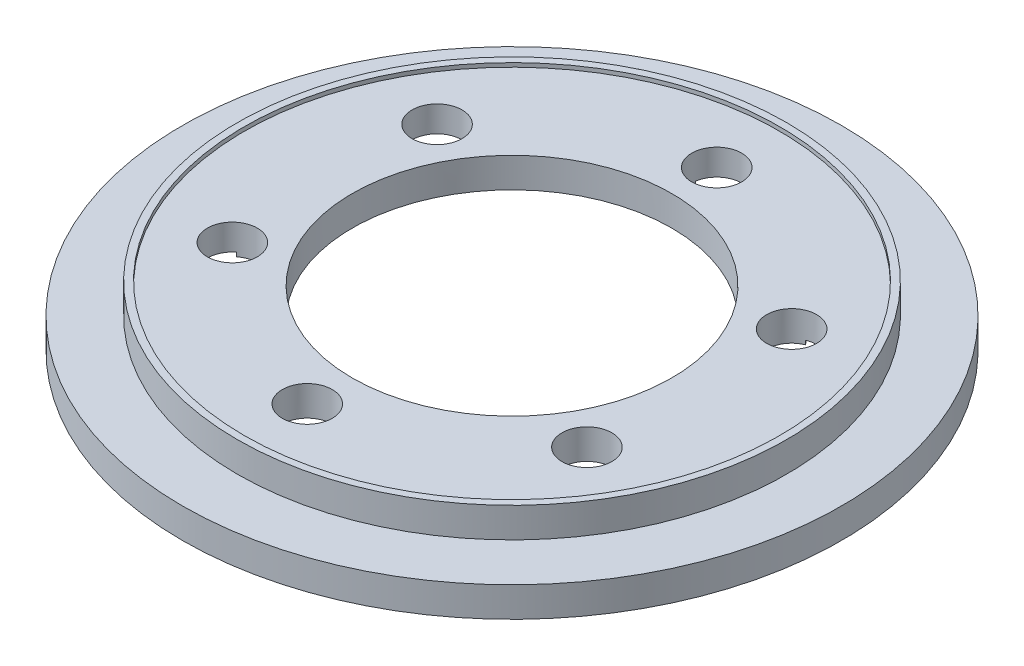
ISO-10303-21;
HEADER;
FILE_DESCRIPTION(('STEP AP214'),'2;1');
FILE_NAME('part.step','',(''),(''),'','','');
FILE_SCHEMA(('AUTOMOTIVE_DESIGN { 1 0 10303 214 1 1 1 1 }'));
ENDSEC;
DATA;
#1=APPLICATION_CONTEXT('core data for automotive mechanical design processes');
#2=APPLICATION_PROTOCOL_DEFINITION('international standard','automotive_design',2000,#1);
#3=PRODUCT_CONTEXT('',#1,'mechanical');
#4=PRODUCT('Part','Part','',(#3));
#5=PRODUCT_RELATED_PRODUCT_CATEGORY('part','',(#4));
#6=PRODUCT_DEFINITION_FORMATION('','',#4);
#7=PRODUCT_DEFINITION_CONTEXT('part definition',#1,'design');
#8=PRODUCT_DEFINITION('design','',#6,#7);
#9=PRODUCT_DEFINITION_SHAPE('','',#8);
#10=(LENGTH_UNIT() NAMED_UNIT(*) SI_UNIT(.MILLI.,.METRE.));
#11=(NAMED_UNIT(*) PLANE_ANGLE_UNIT() SI_UNIT($,.RADIAN.));
#12=(NAMED_UNIT(*) SI_UNIT($,.STERADIAN.) SOLID_ANGLE_UNIT());
#13=UNCERTAINTY_MEASURE_WITH_UNIT(LENGTH_MEASURE(1.E-05),#10,'distance_accuracy_value','');
#14=(GEOMETRIC_REPRESENTATION_CONTEXT(3) GLOBAL_UNCERTAINTY_ASSIGNED_CONTEXT((#13)) GLOBAL_UNIT_ASSIGNED_CONTEXT((#10,
#11,#12)) REPRESENTATION_CONTEXT('',''));
#15=CARTESIAN_POINT('',(0.,0.,0.));
#16=DIRECTION('',(0.,0.,1.));
#17=DIRECTION('',(1.,0.,0.));
#18=AXIS2_PLACEMENT_3D('',#15,#16,#17);
#19=CARTESIAN_POINT('',(0.,1.3,0.));
#20=DIRECTION('',(0.,1.,0.));
#21=DIRECTION('',(0.,0.,1.));
#22=AXIS2_PLACEMENT_3D('',#19,#20,#21);
#23=CYLINDRICAL_SURFACE('',#22,10.5);
#24=CARTESIAN_POINT('',(0.,1.5,0.));
#25=DIRECTION('',(0.,-1.,0.));
#26=DIRECTION('',(0.,0.,-1.));
#27=AXIS2_PLACEMENT_3D('',#24,#25,#26);
#28=CIRCLE('',#27,10.5);
#29=CARTESIAN_POINT('',(-9.64861370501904,1.5,4.14176937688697));
#30=VERTEX_POINT('',#29);
#31=CARTESIAN_POINT('',(-9.64861370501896,1.5,-4.14176937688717));
#32=VERTEX_POINT('',#31);
#33=EDGE_CURVE('E269',#30,#32,#28,.T.);
#34=ORIENTED_EDGE('',*,*,#33,.T.);
#35=DIRECTION('',(0.,1.,0.));
#36=VECTOR('',#35,1.);
#37=CARTESIAN_POINT('',(-9.64861370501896,1.5,-4.14176937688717));
#38=LINE('',#37,#36);
#39=CARTESIAN_POINT('',(-9.64861370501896,1.3,-4.14176937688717));
#40=VERTEX_POINT('',#39);
#41=EDGE_CURVE('E11',#32,#40,#38,.F.);
#42=ORIENTED_EDGE('',*,*,#41,.T.);
#43=CARTESIAN_POINT('',(0.,1.3,0.));
#44=DIRECTION('',(0.,-1.,0.));
#45=DIRECTION('',(0.,0.,-1.));
#46=AXIS2_PLACEMENT_3D('',#43,#44,#45);
#47=CIRCLE('',#46,10.5);
#48=CARTESIAN_POINT('',(-9.64861370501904,1.3,4.14176937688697));
#49=VERTEX_POINT('',#48);
#50=EDGE_CURVE('E396',#49,#40,#47,.T.);
#51=ORIENTED_EDGE('',*,*,#50,.F.);
#52=DIRECTION('',(0.,1.,0.));
#53=VECTOR('',#52,1.);
#54=CARTESIAN_POINT('',(-9.64861370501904,1.5,4.14176937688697));
#55=LINE('',#54,#53);
#56=EDGE_CURVE('E248',#49,#30,#55,.T.);
#57=ORIENTED_EDGE('',*,*,#56,.T.);
#58=EDGE_LOOP('',(#34,#42,#51,#57));
#59=FACE_BOUND('',#58,.T.);
#60=ADVANCED_FACE('F43',(#59),#23,.T.);
#61=CARTESIAN_POINT('',(-1.23742935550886,1.5,10.4268292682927));
#62=VERTEX_POINT('',#61);
#63=CARTESIAN_POINT('',(-8.4111843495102,1.5,6.28505989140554));
#64=VERTEX_POINT('',#63);
#65=EDGE_CURVE('E272',#62,#64,#28,.T.);
#66=ORIENTED_EDGE('',*,*,#65,.T.);
#67=DIRECTION('',(0.,1.,0.));
#68=VECTOR('',#67,1.);
#69=CARTESIAN_POINT('',(-8.4111843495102,1.5,6.28505989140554));
#70=LINE('',#69,#68);
#71=CARTESIAN_POINT('',(-8.4111843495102,1.3,6.28505989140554));
#72=VERTEX_POINT('',#71);
#73=EDGE_CURVE('E251',#64,#72,#70,.F.);
#74=ORIENTED_EDGE('',*,*,#73,.T.);
#75=CARTESIAN_POINT('',(-1.23742935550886,1.3,10.4268292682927));
#76=VERTEX_POINT('',#75);
#77=EDGE_CURVE('E171',#76,#72,#47,.T.);
#78=ORIENTED_EDGE('',*,*,#77,.F.);
#79=DIRECTION('',(0.,1.,0.));
#80=VECTOR('',#79,1.);
#81=CARTESIAN_POINT('',(-1.23742935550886,1.5,10.4268292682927));
#82=LINE('',#81,#80);
#83=EDGE_CURVE('E240',#76,#62,#82,.T.);
#84=ORIENTED_EDGE('',*,*,#83,.T.);
#85=EDGE_LOOP('',(#66,#74,#78,#84));
#86=FACE_BOUND('',#85,.T.);
#87=ADVANCED_FACE('F360',(#86),#23,.T.);
#88=CARTESIAN_POINT('',(8.41118434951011,1.5,6.28505989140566));
#89=VERTEX_POINT('',#88);
#90=CARTESIAN_POINT('',(1.23742935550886,1.5,10.4268292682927));
#91=VERTEX_POINT('',#90);
#92=EDGE_CURVE('E384',#89,#91,#28,.T.);
#93=ORIENTED_EDGE('',*,*,#92,.T.);
#94=DIRECTION('',(0.,1.,0.));
#95=VECTOR('',#94,1.);
#96=CARTESIAN_POINT('',(1.23742935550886,1.5,10.4268292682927));
#97=LINE('',#96,#95);
#98=CARTESIAN_POINT('',(1.23742935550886,1.3,10.4268292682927));
#99=VERTEX_POINT('',#98);
#100=EDGE_CURVE('E244',#91,#99,#97,.F.);
#101=ORIENTED_EDGE('',*,*,#100,.T.);
#102=CARTESIAN_POINT('',(8.41118434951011,1.3,6.28505989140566));
#103=VERTEX_POINT('',#102);
#104=EDGE_CURVE('E164',#103,#99,#47,.T.);
#105=ORIENTED_EDGE('',*,*,#104,.F.);
#106=DIRECTION('',(0.,1.,0.));
#107=VECTOR('',#106,1.);
#108=CARTESIAN_POINT('',(8.41118434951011,1.5,6.28505989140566));
#109=LINE('',#108,#107);
#110=EDGE_CURVE('E234',#103,#89,#109,.T.);
#111=ORIENTED_EDGE('',*,*,#110,.T.);
#112=EDGE_LOOP('',(#93,#101,#105,#111));
#113=FACE_BOUND('',#112,.T.);
#114=ADVANCED_FACE('F366',(#113),#23,.T.);
#115=CARTESIAN_POINT('',(9.64861370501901,1.5,-4.14176937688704));
#116=VERTEX_POINT('',#115);
#117=CARTESIAN_POINT('',(9.64861370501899,1.5,4.14176937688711));
#118=VERTEX_POINT('',#117);
#119=EDGE_CURVE('E180',#116,#118,#28,.T.);
#120=ORIENTED_EDGE('',*,*,#119,.T.);
#121=DIRECTION('',(0.,1.,0.));
#122=VECTOR('',#121,1.);
#123=CARTESIAN_POINT('',(9.64861370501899,1.5,4.14176937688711));
#124=LINE('',#123,#122);
#125=CARTESIAN_POINT('',(9.64861370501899,1.3,4.14176937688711));
#126=VERTEX_POINT('',#125);
#127=EDGE_CURVE('E162',#118,#126,#124,.F.);
#128=ORIENTED_EDGE('',*,*,#127,.T.);
#129=CARTESIAN_POINT('',(9.64861370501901,1.3,-4.14176937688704));
#130=VERTEX_POINT('',#129);
#131=EDGE_CURVE('E154',#130,#126,#47,.T.);
#132=ORIENTED_EDGE('',*,*,#131,.F.);
#133=DIRECTION('',(0.,1.,0.));
#134=VECTOR('',#133,1.);
#135=CARTESIAN_POINT('',(9.64861370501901,1.5,-4.14176937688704));
#136=LINE('',#135,#134);
#137=EDGE_CURVE('E132',#130,#116,#136,.T.);
#138=ORIENTED_EDGE('',*,*,#137,.T.);
#139=EDGE_LOOP('',(#120,#128,#132,#138));
#140=FACE_BOUND('',#139,.T.);
#141=ADVANCED_FACE('F161',(#140),#23,.T.);
#142=CARTESIAN_POINT('',(1.23742935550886,1.5,-10.4268292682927));
#143=VERTEX_POINT('',#142);
#144=CARTESIAN_POINT('',(8.41118434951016,1.5,-6.2850598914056));
#145=VERTEX_POINT('',#144);
#146=EDGE_CURVE('E176',#143,#145,#28,.T.);
#147=ORIENTED_EDGE('',*,*,#146,.T.);
#148=DIRECTION('',(0.,1.,0.));
#149=VECTOR('',#148,1.);
#150=CARTESIAN_POINT('',(8.41118434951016,1.5,-6.2850598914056));
#151=LINE('',#150,#149);
#152=CARTESIAN_POINT('',(8.41118434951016,1.3,-6.2850598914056));
#153=VERTEX_POINT('',#152);
#154=EDGE_CURVE('E144',#145,#153,#151,.F.);
#155=ORIENTED_EDGE('',*,*,#154,.T.);
#156=CARTESIAN_POINT('',(1.23742935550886,1.3,-10.4268292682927));
#157=VERTEX_POINT('',#156);
#158=EDGE_CURVE('E157',#157,#153,#47,.T.);
#159=ORIENTED_EDGE('',*,*,#158,.F.);
#160=DIRECTION('',(0.,1.,0.));
#161=VECTOR('',#160,1.);
#162=CARTESIAN_POINT('',(1.23742935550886,1.5,-10.4268292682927));
#163=LINE('',#162,#161);
#164=EDGE_CURVE('E215',#157,#143,#163,.T.);
#165=ORIENTED_EDGE('',*,*,#164,.T.);
#166=EDGE_LOOP('',(#147,#155,#159,#165));
#167=FACE_BOUND('',#166,.T.);
#168=ADVANCED_FACE('F355',(#167),#23,.T.);
#169=CARTESIAN_POINT('',(0.,1.5,0.));
#170=DIRECTION('',(0.,-1.,0.));
#171=DIRECTION('',(0.,0.,-1.));
#172=AXIS2_PLACEMENT_3D('',#169,#170,#171);
#173=PLANE('',#172);
#174=CARTESIAN_POINT('',(-8.87676038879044,1.5,-5.1250000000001));
#175=DIRECTION('',(0.,-1.,0.));
#176=DIRECTION('',(0.,0.,-1.));
#177=AXIS2_PLACEMENT_3D('',#174,#175,#176);
#178=CIRCLE('',#177,1.25);
#179=CARTESIAN_POINT('',(-8.41118434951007,1.5,-6.28505989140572));
#180=VERTEX_POINT('',#179);
#181=EDGE_CURVE('E59',#32,#180,#178,.T.);
#182=ORIENTED_EDGE('',*,*,#181,.F.);
#183=ORIENTED_EDGE('',*,*,#33,.F.);
#184=CARTESIAN_POINT('',(-8.87676038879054,1.5,5.12499999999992));
#185=DIRECTION('',(0.,-1.,0.));
#186=DIRECTION('',(0.,0.,-1.));
#187=AXIS2_PLACEMENT_3D('',#184,#185,#186);
#188=CIRCLE('',#187,1.25);
#189=EDGE_CURVE('E67',#64,#30,#188,.T.);
#190=ORIENTED_EDGE('',*,*,#189,.F.);
#191=ORIENTED_EDGE('',*,*,#65,.F.);
#192=CARTESIAN_POINT('',(0.,1.5,10.25));
#193=DIRECTION('',(0.,-1.,0.));
#194=DIRECTION('',(0.,0.,-1.));
#195=AXIS2_PLACEMENT_3D('',#192,#193,#194);
#196=CIRCLE('',#195,1.25);
#197=EDGE_CURVE('E310',#91,#62,#196,.T.);
#198=ORIENTED_EDGE('',*,*,#197,.F.);
#199=ORIENTED_EDGE('',*,*,#92,.F.);
#200=CARTESIAN_POINT('',(8.87676038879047,1.5,5.12500000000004));
#201=DIRECTION('',(0.,-1.,0.));
#202=DIRECTION('',(0.,0.,-1.));
#203=AXIS2_PLACEMENT_3D('',#200,#201,#202);
#204=CIRCLE('',#203,1.25);
#205=EDGE_CURVE('E320',#118,#89,#204,.T.);
#206=ORIENTED_EDGE('',*,*,#205,.F.);
#207=ORIENTED_EDGE('',*,*,#119,.F.);
#208=CARTESIAN_POINT('',(8.87676038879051,1.5,-5.12499999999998));
#209=DIRECTION('',(0.,-1.,0.));
#210=DIRECTION('',(0.,0.,-1.));
#211=AXIS2_PLACEMENT_3D('',#208,#209,#210);
#212=CIRCLE('',#211,1.25);
#213=EDGE_CURVE('E138',#145,#116,#212,.T.);
#214=ORIENTED_EDGE('',*,*,#213,.F.);
#215=ORIENTED_EDGE('',*,*,#146,.F.);
#216=CARTESIAN_POINT('',(0.,1.5,-10.25));
#217=DIRECTION('',(0.,-1.,0.));
#218=DIRECTION('',(0.,0.,-1.));
#219=AXIS2_PLACEMENT_3D('',#216,#217,#218);
#220=CIRCLE('',#219,1.25);
#221=CARTESIAN_POINT('',(-1.23742935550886,1.5,-10.4268292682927));
#222=VERTEX_POINT('',#221);
#223=EDGE_CURVE('E267',#222,#143,#220,.T.);
#224=ORIENTED_EDGE('',*,*,#223,.F.);
#225=EDGE_CURVE('E181',#180,#222,#28,.T.);
#226=ORIENTED_EDGE('',*,*,#225,.F.);
#227=EDGE_LOOP('',(#182,#183,#190,#191,#198,#199,#206,#207,#214,#215,#224,#226));
#228=FACE_BOUND('',#227,.T.);
#229=CARTESIAN_POINT('',(0.,1.5,0.));
#230=DIRECTION('',(0.,-1.,0.));
#231=DIRECTION('',(0.,0.,-1.));
#232=AXIS2_PLACEMENT_3D('',#229,#230,#231);
#233=CIRCLE('',#232,12.5);
#234=CARTESIAN_POINT('',(0.,1.5,-12.5));
#235=VERTEX_POINT('',#234);
#236=EDGE_CURVE('E190',#235,#235,#233,.T.);
#237=ORIENTED_EDGE('',*,*,#236,.T.);
#238=EDGE_LOOP('',(#237));
#239=FACE_BOUND('',#238,.T.);
#240=ADVANCED_FACE('F262',(#228,#239),#173,.T.);
#241=CARTESIAN_POINT('',(0.,0.,0.));
#242=DIRECTION('',(0.,1.,0.));
#243=DIRECTION('',(0.,0.,1.));
#244=AXIS2_PLACEMENT_3D('',#241,#242,#243);
#245=CYLINDRICAL_SURFACE('',#244,8.);
#246=CARTESIAN_POINT('',(0.,2.8,0.));
#247=DIRECTION('',(0.,1.,0.));
#248=DIRECTION('',(0.,0.,1.));
#249=AXIS2_PLACEMENT_3D('',#246,#247,#248);
#250=CIRCLE('',#249,8.);
#251=CARTESIAN_POINT('',(0.,2.8,8.));
#252=VERTEX_POINT('',#251);
#253=EDGE_CURVE('E186',#252,#252,#250,.F.);
#254=ORIENTED_EDGE('',*,*,#253,.F.);
#255=EDGE_LOOP('',(#254));
#256=FACE_BOUND('',#255,.T.);
#257=CARTESIAN_POINT('',(0.,1.3,0.));
#258=DIRECTION('',(0.,-1.,0.));
#259=DIRECTION('',(0.,0.,-1.));
#260=AXIS2_PLACEMENT_3D('',#257,#258,#259);
#261=CIRCLE('',#260,8.);
#262=CARTESIAN_POINT('',(0.,1.3,-8.));
#263=VERTEX_POINT('',#262);
#264=EDGE_CURVE('E174',#263,#263,#261,.T.);
#265=ORIENTED_EDGE('',*,*,#264,.T.);
#266=EDGE_LOOP('',(#265));
#267=FACE_BOUND('',#266,.T.);
#268=ADVANCED_FACE('F346',(#256,#267),#245,.F.);
#269=CARTESIAN_POINT('',(0.,1.5,0.));
#270=DIRECTION('',(0.,-1.,0.));
#271=DIRECTION('',(0.,0.,-1.));
#272=AXIS2_PLACEMENT_3D('',#269,#270,#271);
#273=CYLINDRICAL_SURFACE('',#272,16.5);
#274=CARTESIAN_POINT('',(0.,1.5,0.));
#275=DIRECTION('',(0.,1.,0.));
#276=DIRECTION('',(0.,0.,1.));
#277=AXIS2_PLACEMENT_3D('',#274,#275,#276);
#278=CIRCLE('',#277,16.5);
#279=CARTESIAN_POINT('',(0.,1.5,16.5));
#280=VERTEX_POINT('',#279);
#281=EDGE_CURVE('E216',#280,#280,#278,.T.);
#282=ORIENTED_EDGE('',*,*,#281,.F.);
#283=EDGE_LOOP('',(#282));
#284=FACE_BOUND('',#283,.T.);
#285=CARTESIAN_POINT('',(0.,0.,0.));
#286=DIRECTION('',(0.,1.,0.));
#287=DIRECTION('',(0.,0.,1.));
#288=AXIS2_PLACEMENT_3D('',#285,#286,#287);
#289=CIRCLE('',#288,16.5);
#290=CARTESIAN_POINT('',(0.,0.,16.5));
#291=VERTEX_POINT('',#290);
#292=EDGE_CURVE('E210',#291,#291,#289,.T.);
#293=ORIENTED_EDGE('',*,*,#292,.T.);
#294=EDGE_LOOP('',(#293));
#295=FACE_BOUND('',#294,.T.);
#296=ADVANCED_FACE('F45',(#284,#295),#273,.T.);
#297=CARTESIAN_POINT('',(0.,1.5,0.));
#298=DIRECTION('',(0.,1.,0.));
#299=DIRECTION('',(0.,0.,1.));
#300=AXIS2_PLACEMENT_3D('',#297,#298,#299);
#301=PLANE('',#300);
#302=CARTESIAN_POINT('',(0.,1.5,0.));
#303=DIRECTION('',(0.,1.,0.));
#304=DIRECTION('',(0.,0.,1.));
#305=AXIS2_PLACEMENT_3D('',#302,#303,#304);
#306=CIRCLE('',#305,13.75);
#307=CARTESIAN_POINT('',(0.,1.5,13.75));
#308=VERTEX_POINT('',#307);
#309=EDGE_CURVE('E211',#308,#308,#306,.T.);
#310=ORIENTED_EDGE('',*,*,#309,.F.);
#311=EDGE_LOOP('',(#310));
#312=FACE_BOUND('',#311,.T.);
#313=ORIENTED_EDGE('',*,*,#281,.T.);
#314=EDGE_LOOP('',(#313));
#315=FACE_BOUND('',#314,.T.);
#316=ADVANCED_FACE('F353',(#312,#315),#301,.T.);
#317=CARTESIAN_POINT('',(0.,0.,0.));
#318=DIRECTION('',(0.,1.,0.));
#319=DIRECTION('',(0.,0.,1.));
#320=AXIS2_PLACEMENT_3D('',#317,#318,#319);
#321=PLANE('',#320);
#322=CARTESIAN_POINT('',(0.,0.,0.));
#323=DIRECTION('',(0.,-1.,0.));
#324=DIRECTION('',(0.,0.,-1.));
#325=AXIS2_PLACEMENT_3D('',#322,#323,#324);
#326=CIRCLE('',#325,15.5);
#327=CARTESIAN_POINT('',(0.,0.,-15.5));
#328=VERTEX_POINT('',#327);
#329=EDGE_CURVE('E194',#328,#328,#326,.T.);
#330=ORIENTED_EDGE('',*,*,#329,.F.);
#331=EDGE_LOOP('',(#330));
#332=FACE_BOUND('',#331,.T.);
#333=ORIENTED_EDGE('',*,*,#292,.F.);
#334=EDGE_LOOP('',(#333));
#335=FACE_BOUND('',#334,.T.);
#336=ADVANCED_FACE('F595',(#332,#335),#321,.F.);
#337=CARTESIAN_POINT('',(0.,3.,0.));
#338=DIRECTION('',(0.,-1.,0.));
#339=DIRECTION('',(0.,0.,-1.));
#340=AXIS2_PLACEMENT_3D('',#337,#338,#339);
#341=CYLINDRICAL_SURFACE('',#340,13.75);
#342=CARTESIAN_POINT('',(0.,3.,0.));
#343=DIRECTION('',(0.,1.,0.));
#344=DIRECTION('',(0.,0.,1.));
#345=AXIS2_PLACEMENT_3D('',#342,#343,#344);
#346=CIRCLE('',#345,13.75);
#347=CARTESIAN_POINT('',(0.,3.,13.75));
#348=VERTEX_POINT('',#347);
#349=EDGE_CURVE('E203',#348,#348,#346,.T.);
#350=ORIENTED_EDGE('',*,*,#349,.F.);
#351=EDGE_LOOP('',(#350));
#352=FACE_BOUND('',#351,.T.);
#353=ORIENTED_EDGE('',*,*,#309,.T.);
#354=EDGE_LOOP('',(#353));
#355=FACE_BOUND('',#354,.T.);
#356=ADVANCED_FACE('F558',(#352,#355),#341,.T.);
#357=CARTESIAN_POINT('',(0.,3.,0.));
#358=DIRECTION('',(0.,1.,0.));
#359=DIRECTION('',(0.,0.,1.));
#360=AXIS2_PLACEMENT_3D('',#357,#358,#359);
#361=PLANE('',#360);
#362=CARTESIAN_POINT('',(0.,3.,0.));
#363=DIRECTION('',(0.,1.,0.));
#364=DIRECTION('',(0.,0.,1.));
#365=AXIS2_PLACEMENT_3D('',#362,#363,#364);
#366=CIRCLE('',#365,13.4);
#367=CARTESIAN_POINT('',(0.,3.,13.4));
#368=VERTEX_POINT('',#367);
#369=EDGE_CURVE('E168',#368,#368,#366,.T.);
#370=ORIENTED_EDGE('',*,*,#369,.F.);
#371=EDGE_LOOP('',(#370));
#372=FACE_BOUND('',#371,.T.);
#373=ORIENTED_EDGE('',*,*,#349,.T.);
#374=EDGE_LOOP('',(#373));
#375=FACE_BOUND('',#374,.T.);
#376=ADVANCED_FACE('F552',(#372,#375),#361,.T.);
#377=CARTESIAN_POINT('',(0.,1.,0.));
#378=DIRECTION('',(0.,-1.,0.));
#379=DIRECTION('',(0.,0.,-1.));
#380=AXIS2_PLACEMENT_3D('',#377,#378,#379);
#381=CYLINDRICAL_SURFACE('',#380,15.5);
#382=CARTESIAN_POINT('',(0.,1.,0.));
#383=DIRECTION('',(0.,-1.,0.));
#384=DIRECTION('',(0.,0.,-1.));
#385=AXIS2_PLACEMENT_3D('',#382,#383,#384);
#386=CIRCLE('',#385,15.5);
#387=CARTESIAN_POINT('',(0.,1.,-15.5));
#388=VERTEX_POINT('',#387);
#389=EDGE_CURVE('E199',#388,#388,#386,.T.);
#390=ORIENTED_EDGE('',*,*,#389,.F.);
#391=EDGE_LOOP('',(#390));
#392=FACE_BOUND('',#391,.T.);
#393=ORIENTED_EDGE('',*,*,#329,.T.);
#394=EDGE_LOOP('',(#393));
#395=FACE_BOUND('',#394,.T.);
#396=ADVANCED_FACE('F557',(#392,#395),#381,.F.);
#397=CARTESIAN_POINT('',(0.,1.,0.));
#398=DIRECTION('',(0.,-1.,0.));
#399=DIRECTION('',(0.,0.,-1.));
#400=AXIS2_PLACEMENT_3D('',#397,#398,#399);
#401=PLANE('',#400);
#402=CARTESIAN_POINT('',(0.,1.,0.));
#403=DIRECTION('',(0.,-1.,0.));
#404=DIRECTION('',(0.,0.,-1.));
#405=AXIS2_PLACEMENT_3D('',#402,#403,#404);
#406=CIRCLE('',#405,12.5);
#407=CARTESIAN_POINT('',(0.,1.,-12.5));
#408=VERTEX_POINT('',#407);
#409=EDGE_CURVE('E195',#408,#408,#406,.T.);
#410=ORIENTED_EDGE('',*,*,#409,.F.);
#411=EDGE_LOOP('',(#410));
#412=FACE_BOUND('',#411,.T.);
#413=ORIENTED_EDGE('',*,*,#389,.T.);
#414=EDGE_LOOP('',(#413));
#415=FACE_BOUND('',#414,.T.);
#416=ADVANCED_FACE('F572',(#412,#415),#401,.T.);
#417=CARTESIAN_POINT('',(0.,1.5,0.));
#418=DIRECTION('',(0.,-1.,0.));
#419=DIRECTION('',(0.,0.,-1.));
#420=AXIS2_PLACEMENT_3D('',#417,#418,#419);
#421=CYLINDRICAL_SURFACE('',#420,12.5);
#422=ORIENTED_EDGE('',*,*,#236,.F.);
#423=EDGE_LOOP('',(#422));
#424=FACE_BOUND('',#423,.T.);
#425=ORIENTED_EDGE('',*,*,#409,.T.);
#426=EDGE_LOOP('',(#425));
#427=FACE_BOUND('',#426,.T.);
#428=ADVANCED_FACE('F338',(#424,#427),#421,.F.);
#429=CARTESIAN_POINT('',(0.,2.8,0.));
#430=DIRECTION('',(0.,1.,0.));
#431=DIRECTION('',(0.,0.,1.));
#432=AXIS2_PLACEMENT_3D('',#429,#430,#431);
#433=PLANE('',#432);
#434=CARTESIAN_POINT('',(-8.87676038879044,2.8,-5.1250000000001));
#435=DIRECTION('',(0.,1.,0.));
#436=DIRECTION('',(0.,0.,1.));
#437=AXIS2_PLACEMENT_3D('',#434,#435,#436);
#438=CIRCLE('',#437,1.25);
#439=CARTESIAN_POINT('',(-8.87676038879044,2.8,-3.8750000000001));
#440=VERTEX_POINT('',#439);
#441=EDGE_CURVE('E288',#440,#440,#438,.T.);
#442=ORIENTED_EDGE('',*,*,#441,.F.);
#443=EDGE_LOOP('',(#442));
#444=FACE_BOUND('',#443,.T.);
#445=CARTESIAN_POINT('',(-8.87676038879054,2.8,5.12499999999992));
#446=DIRECTION('',(0.,1.,0.));
#447=DIRECTION('',(0.,0.,1.));
#448=AXIS2_PLACEMENT_3D('',#445,#446,#447);
#449=CIRCLE('',#448,1.25);
#450=CARTESIAN_POINT('',(-8.87676038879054,2.8,6.37499999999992));
#451=VERTEX_POINT('',#450);
#452=EDGE_CURVE('E297',#451,#451,#449,.T.);
#453=ORIENTED_EDGE('',*,*,#452,.F.);
#454=EDGE_LOOP('',(#453));
#455=FACE_BOUND('',#454,.T.);
#456=CARTESIAN_POINT('',(0.,2.8,10.25));
#457=DIRECTION('',(0.,1.,0.));
#458=DIRECTION('',(0.,0.,1.));
#459=AXIS2_PLACEMENT_3D('',#456,#457,#458);
#460=CIRCLE('',#459,1.25);
#461=CARTESIAN_POINT('',(0.,2.8,11.5));
#462=VERTEX_POINT('',#461);
#463=EDGE_CURVE('E306',#462,#462,#460,.T.);
#464=ORIENTED_EDGE('',*,*,#463,.F.);
#465=EDGE_LOOP('',(#464));
#466=FACE_BOUND('',#465,.T.);
#467=CARTESIAN_POINT('',(8.87676038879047,2.8,5.12500000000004));
#468=DIRECTION('',(0.,1.,0.));
#469=DIRECTION('',(0.,0.,1.));
#470=AXIS2_PLACEMENT_3D('',#467,#468,#469);
#471=CIRCLE('',#470,1.25);
#472=CARTESIAN_POINT('',(8.87676038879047,2.8,6.37500000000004));
#473=VERTEX_POINT('',#472);
#474=EDGE_CURVE('E316',#473,#473,#471,.T.);
#475=ORIENTED_EDGE('',*,*,#474,.F.);
#476=EDGE_LOOP('',(#475));
#477=FACE_BOUND('',#476,.T.);
#478=CARTESIAN_POINT('',(8.87676038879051,2.8,-5.12499999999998));
#479=DIRECTION('',(0.,1.,0.));
#480=DIRECTION('',(0.,0.,1.));
#481=AXIS2_PLACEMENT_3D('',#478,#479,#480);
#482=CIRCLE('',#481,1.25);
#483=CARTESIAN_POINT('',(8.87676038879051,2.8,-3.87499999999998));
#484=VERTEX_POINT('',#483);
#485=EDGE_CURVE('E326',#484,#484,#482,.T.);
#486=ORIENTED_EDGE('',*,*,#485,.F.);
#487=EDGE_LOOP('',(#486));
#488=FACE_BOUND('',#487,.T.);
#489=CARTESIAN_POINT('',(0.,2.8,-10.25));
#490=DIRECTION('',(0.,1.,0.));
#491=DIRECTION('',(0.,0.,1.));
#492=AXIS2_PLACEMENT_3D('',#489,#490,#491);
#493=CIRCLE('',#492,1.25);
#494=CARTESIAN_POINT('',(0.,2.8,-9.));
#495=VERTEX_POINT('',#494);
#496=EDGE_CURVE('E274',#495,#495,#493,.T.);
#497=ORIENTED_EDGE('',*,*,#496,.F.);
#498=EDGE_LOOP('',(#497));
#499=FACE_BOUND('',#498,.T.);
#500=CARTESIAN_POINT('',(0.,2.8,0.));
#501=DIRECTION('',(0.,1.,0.));
#502=DIRECTION('',(0.,0.,1.));
#503=AXIS2_PLACEMENT_3D('',#500,#501,#502);
#504=CIRCLE('',#503,13.4);
#505=CARTESIAN_POINT('',(0.,2.8,13.4));
#506=VERTEX_POINT('',#505);
#507=EDGE_CURVE('E182',#506,#506,#504,.T.);
#508=ORIENTED_EDGE('',*,*,#507,.T.);
#509=EDGE_LOOP('',(#508));
#510=FACE_BOUND('',#509,.T.);
#511=ORIENTED_EDGE('',*,*,#253,.T.);
#512=EDGE_LOOP('',(#511));
#513=FACE_BOUND('',#512,.T.);
#514=ADVANCED_FACE('F334',(#444,#455,#466,#477,#488,#499,#510,#513),#433,.T.);
#515=CARTESIAN_POINT('',(0.,2.8,0.));
#516=DIRECTION('',(0.,1.,0.));
#517=DIRECTION('',(0.,0.,1.));
#518=AXIS2_PLACEMENT_3D('',#515,#516,#517);
#519=CYLINDRICAL_SURFACE('',#518,13.4);
#520=ORIENTED_EDGE('',*,*,#507,.F.);
#521=EDGE_LOOP('',(#520));
#522=FACE_BOUND('',#521,.T.);
#523=ORIENTED_EDGE('',*,*,#369,.T.);
#524=EDGE_LOOP('',(#523));
#525=FACE_BOUND('',#524,.T.);
#526=ADVANCED_FACE('F337',(#522,#525),#519,.F.);
#527=CARTESIAN_POINT('',(0.,1.3,0.));
#528=DIRECTION('',(0.,-1.,0.));
#529=DIRECTION('',(0.,0.,-1.));
#530=AXIS2_PLACEMENT_3D('',#527,#528,#529);
#531=PLANE('',#530);
#532=CARTESIAN_POINT('',(-8.87676038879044,1.3,-5.1250000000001));
#533=DIRECTION('',(0.,-1.,0.));
#534=DIRECTION('',(0.,0.,-1.));
#535=AXIS2_PLACEMENT_3D('',#532,#533,#534);
#536=CIRCLE('',#535,1.25);
#537=CARTESIAN_POINT('',(-8.41118434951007,1.3,-6.28505989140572));
#538=VERTEX_POINT('',#537);
#539=EDGE_CURVE('E294',#538,#40,#536,.T.);
#540=ORIENTED_EDGE('',*,*,#539,.F.);
#541=CARTESIAN_POINT('',(-1.23742935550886,1.3,-10.4268292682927));
#542=VERTEX_POINT('',#541);
#543=EDGE_CURVE('E169',#538,#542,#47,.T.);
#544=ORIENTED_EDGE('',*,*,#543,.T.);
#545=CARTESIAN_POINT('',(0.,1.3,-10.25));
#546=DIRECTION('',(0.,-1.,0.));
#547=DIRECTION('',(0.,0.,-1.));
#548=AXIS2_PLACEMENT_3D('',#545,#546,#547);
#549=CIRCLE('',#548,1.25);
#550=EDGE_CURVE('E282',#157,#542,#549,.T.);
#551=ORIENTED_EDGE('',*,*,#550,.F.);
#552=ORIENTED_EDGE('',*,*,#158,.T.);
#553=CARTESIAN_POINT('',(8.87676038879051,1.3,-5.12499999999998));
#554=DIRECTION('',(0.,-1.,0.));
#555=DIRECTION('',(0.,0.,-1.));
#556=AXIS2_PLACEMENT_3D('',#553,#554,#555);
#557=CIRCLE('',#556,1.25);
#558=EDGE_CURVE('E135',#130,#153,#557,.T.);
#559=ORIENTED_EDGE('',*,*,#558,.F.);
#560=ORIENTED_EDGE('',*,*,#131,.T.);
#561=CARTESIAN_POINT('',(8.87676038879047,1.3,5.12500000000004));
#562=DIRECTION('',(0.,-1.,0.));
#563=DIRECTION('',(0.,0.,-1.));
#564=AXIS2_PLACEMENT_3D('',#561,#562,#563);
#565=CIRCLE('',#564,1.25);
#566=EDGE_CURVE('E323',#103,#126,#565,.T.);
#567=ORIENTED_EDGE('',*,*,#566,.F.);
#568=ORIENTED_EDGE('',*,*,#104,.T.);
#569=CARTESIAN_POINT('',(0.,1.3,10.25));
#570=DIRECTION('',(0.,-1.,0.));
#571=DIRECTION('',(0.,0.,-1.));
#572=AXIS2_PLACEMENT_3D('',#569,#570,#571);
#573=CIRCLE('',#572,1.25);
#574=EDGE_CURVE('E313',#76,#99,#573,.T.);
#575=ORIENTED_EDGE('',*,*,#574,.F.);
#576=ORIENTED_EDGE('',*,*,#77,.T.);
#577=CARTESIAN_POINT('',(-8.87676038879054,1.3,5.12499999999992));
#578=DIRECTION('',(0.,-1.,0.));
#579=DIRECTION('',(0.,0.,-1.));
#580=AXIS2_PLACEMENT_3D('',#577,#578,#579);
#581=CIRCLE('',#580,1.25);
#582=EDGE_CURVE('E303',#49,#72,#581,.T.);
#583=ORIENTED_EDGE('',*,*,#582,.F.);
#584=ORIENTED_EDGE('',*,*,#50,.T.);
#585=EDGE_LOOP('',(#540,#544,#551,#552,#559,#560,#567,#568,#575,#576,#583,#584));
#586=FACE_BOUND('',#585,.T.);
#587=ORIENTED_EDGE('',*,*,#264,.F.);
#588=EDGE_LOOP('',(#587));
#589=FACE_BOUND('',#588,.T.);
#590=ADVANCED_FACE('F151',(#586,#589),#531,.T.);
#591=ORIENTED_EDGE('',*,*,#543,.F.);
#592=DIRECTION('',(0.,1.,0.));
#593=VECTOR('',#592,1.);
#594=CARTESIAN_POINT('',(-8.41118434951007,1.5,-6.28505989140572));
#595=LINE('',#594,#593);
#596=EDGE_CURVE('E52',#538,#180,#595,.T.);
#597=ORIENTED_EDGE('',*,*,#596,.T.);
#598=ORIENTED_EDGE('',*,*,#225,.T.);
#599=DIRECTION('',(0.,1.,0.));
#600=VECTOR('',#599,1.);
#601=CARTESIAN_POINT('',(-1.23742935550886,1.5,-10.4268292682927));
#602=LINE('',#601,#600);
#603=EDGE_CURVE('E145',#222,#542,#602,.F.);
#604=ORIENTED_EDGE('',*,*,#603,.T.);
#605=EDGE_LOOP('',(#591,#597,#598,#604));
#606=FACE_BOUND('',#605,.T.);
#607=ADVANCED_FACE('F258',(#606),#23,.T.);
#608=CARTESIAN_POINT('',(0.,0.,-10.25));
#609=DIRECTION('',(0.,1.,0.));
#610=DIRECTION('',(0.,0.,1.));
#611=AXIS2_PLACEMENT_3D('',#608,#609,#610);
#612=CYLINDRICAL_SURFACE('',#611,1.25);
#613=ORIENTED_EDGE('',*,*,#496,.T.);
#614=EDGE_LOOP('',(#613));
#615=FACE_BOUND('',#614,.T.);
#616=ORIENTED_EDGE('',*,*,#223,.T.);
#617=ORIENTED_EDGE('',*,*,#164,.F.);
#618=ORIENTED_EDGE('',*,*,#550,.T.);
#619=ORIENTED_EDGE('',*,*,#603,.F.);
#620=EDGE_LOOP('',(#616,#617,#618,#619));
#621=FACE_BOUND('',#620,.T.);
#622=ADVANCED_FACE('F370',(#615,#621),#612,.F.);
#623=CARTESIAN_POINT('',(8.87676038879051,0.,-5.12499999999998));
#624=DIRECTION('',(0.,1.,0.));
#625=DIRECTION('',(0.,0.,1.));
#626=AXIS2_PLACEMENT_3D('',#623,#624,#625);
#627=CYLINDRICAL_SURFACE('',#626,1.25);
#628=ORIENTED_EDGE('',*,*,#485,.T.);
#629=EDGE_LOOP('',(#628));
#630=FACE_BOUND('',#629,.T.);
#631=ORIENTED_EDGE('',*,*,#213,.T.);
#632=ORIENTED_EDGE('',*,*,#137,.F.);
#633=ORIENTED_EDGE('',*,*,#558,.T.);
#634=ORIENTED_EDGE('',*,*,#154,.F.);
#635=EDGE_LOOP('',(#631,#632,#633,#634));
#636=FACE_BOUND('',#635,.T.);
#637=ADVANCED_FACE('F134',(#630,#636),#627,.F.);
#638=CARTESIAN_POINT('',(8.87676038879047,0.,5.12500000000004));
#639=DIRECTION('',(0.,1.,0.));
#640=DIRECTION('',(0.,0.,1.));
#641=AXIS2_PLACEMENT_3D('',#638,#639,#640);
#642=CYLINDRICAL_SURFACE('',#641,1.25);
#643=ORIENTED_EDGE('',*,*,#474,.T.);
#644=EDGE_LOOP('',(#643));
#645=FACE_BOUND('',#644,.T.);
#646=ORIENTED_EDGE('',*,*,#205,.T.);
#647=ORIENTED_EDGE('',*,*,#110,.F.);
#648=ORIENTED_EDGE('',*,*,#566,.T.);
#649=ORIENTED_EDGE('',*,*,#127,.F.);
#650=EDGE_LOOP('',(#646,#647,#648,#649));
#651=FACE_BOUND('',#650,.T.);
#652=ADVANCED_FACE('F417',(#645,#651),#642,.F.);
#653=CARTESIAN_POINT('',(0.,0.,10.25));
#654=DIRECTION('',(0.,1.,0.));
#655=DIRECTION('',(0.,0.,1.));
#656=AXIS2_PLACEMENT_3D('',#653,#654,#655);
#657=CYLINDRICAL_SURFACE('',#656,1.25);
#658=ORIENTED_EDGE('',*,*,#463,.T.);
#659=EDGE_LOOP('',(#658));
#660=FACE_BOUND('',#659,.T.);
#661=ORIENTED_EDGE('',*,*,#197,.T.);
#662=ORIENTED_EDGE('',*,*,#83,.F.);
#663=ORIENTED_EDGE('',*,*,#574,.T.);
#664=ORIENTED_EDGE('',*,*,#100,.F.);
#665=EDGE_LOOP('',(#661,#662,#663,#664));
#666=FACE_BOUND('',#665,.T.);
#667=ADVANCED_FACE('F411',(#660,#666),#657,.F.);
#668=CARTESIAN_POINT('',(-8.87676038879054,0.,5.12499999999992));
#669=DIRECTION('',(0.,1.,0.));
#670=DIRECTION('',(0.,0.,1.));
#671=AXIS2_PLACEMENT_3D('',#668,#669,#670);
#672=CYLINDRICAL_SURFACE('',#671,1.25);
#673=ORIENTED_EDGE('',*,*,#452,.T.);
#674=EDGE_LOOP('',(#673));
#675=FACE_BOUND('',#674,.T.);
#676=ORIENTED_EDGE('',*,*,#189,.T.);
#677=ORIENTED_EDGE('',*,*,#56,.F.);
#678=ORIENTED_EDGE('',*,*,#582,.T.);
#679=ORIENTED_EDGE('',*,*,#73,.F.);
#680=EDGE_LOOP('',(#676,#677,#678,#679));
#681=FACE_BOUND('',#680,.T.);
#682=ADVANCED_FACE('F398',(#675,#681),#672,.F.);
#683=CARTESIAN_POINT('',(-8.87676038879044,0.,-5.1250000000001));
#684=DIRECTION('',(0.,1.,0.));
#685=DIRECTION('',(0.,0.,1.));
#686=AXIS2_PLACEMENT_3D('',#683,#684,#685);
#687=CYLINDRICAL_SURFACE('',#686,1.25);
#688=ORIENTED_EDGE('',*,*,#441,.T.);
#689=EDGE_LOOP('',(#688));
#690=FACE_BOUND('',#689,.T.);
#691=ORIENTED_EDGE('',*,*,#181,.T.);
#692=ORIENTED_EDGE('',*,*,#596,.F.);
#693=ORIENTED_EDGE('',*,*,#539,.T.);
#694=ORIENTED_EDGE('',*,*,#41,.F.);
#695=EDGE_LOOP('',(#691,#692,#693,#694));
#696=FACE_BOUND('',#695,.T.);
#697=ADVANCED_FACE('F404',(#690,#696),#687,.F.);
#698=CLOSED_SHELL('',(#60,#87,#114,#141,#168,#240,#268,#296,#316,#336,#356,#376,#396,#416,#428,
#514,#526,#590,#607,#622,#637,#652,#667,#682,#697));
#699=MANIFOLD_SOLID_BREP('B2',#698);
#700=ADVANCED_BREP_SHAPE_REPRESENTATION('',(#18,#699),#14);
#701=SHAPE_DEFINITION_REPRESENTATION(#9,#700);
ENDSEC;
END-ISO-10303-21;
